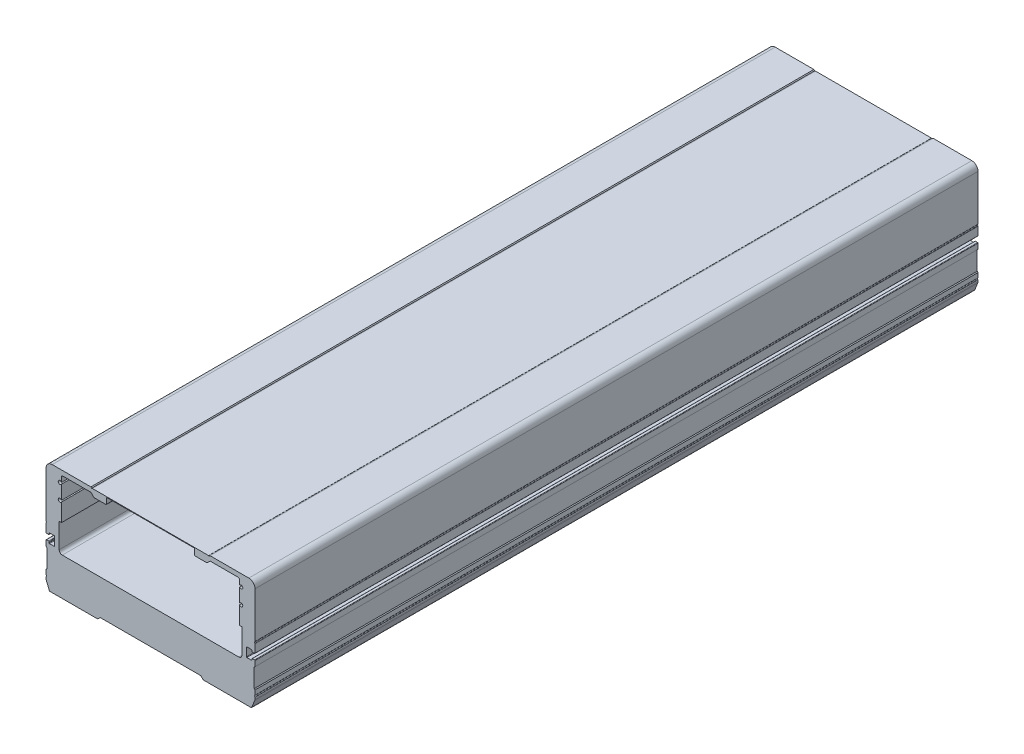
from build123d import *

# Parameters (mm, degrees)
EXTRUDE_1_DEPTH      = 467
HOLE_WIZARD_M6_D     = 5
HOLE_WIZARD_M6_DEPTH = 15
HOLE_WIZARD_M6_TIP   = 1.502151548


with BuildPart() as part:
    # Sketch 1 → Extrude 1 (new body)
    with BuildSketch(Plane.XY):
        with BuildLine():
            Line((-67.5, 66.1), (-67.5, 36.604669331))
            ThreePointArc((-67.5, 36.604669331), (-67.454950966, 36.446555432), (-67.3333333, 36.33592739))
            ThreePointArc((-67.3333333, 36.33592739), (-67.125, 35.999999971), (-67.333333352, 35.664072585))
            ThreePointArc((-67.333333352, 35.664072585), (-67.454950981, 35.553444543), (-67.5, 35.395330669))
            Line((-67.5, 35.395330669), (-67.5, 30.1))
            ThreePointArc((-67.5, 30.1), (-67.412132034, 29.887867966), (-67.2, 29.8))
            Line((-67.2, 29.8), (-65.8, 29.8))
            ThreePointArc((-65.8, 29.8), (-65.587867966, 29.887867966), (-65.5, 30.1))
            Line((-65.5, 30.1), (-65.5, 30.7))
            ThreePointArc((-65.5, 30.7), (-65.412132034, 30.912132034), (-65.2, 31))
            Line((-65.2, 31), (-62.3, 31))
            ThreePointArc((-62.3, 31), (-62.087867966, 30.912132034), (-62, 30.7))
            Line((-62, 30.7), (-62, 25.3))
            ThreePointArc((-62, 25.3), (-62.087867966, 25.087867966), (-62.3, 25))
            Line((-62.3, 25), (-65.2, 25))
            ThreePointArc((-65.2, 25), (-65.412132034, 25.087867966), (-65.5, 25.3))
            Line((-65.5, 25.3), (-65.5, 25.9))
            ThreePointArc((-65.5, 25.9), (-65.587867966, 26.112132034), (-65.8, 26.2))
            Line((-65.8, 26.2), (-67.2, 26.2))
            ThreePointArc((-67.2, 26.2), (-67.412132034, 26.112132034), (-67.5, 25.9))
            Line((-67.5, 25.9), (-67.5, 22.5))
            Line((-67.5, 22.5), (-67, 22))
            Line((-67, 22), (-67, 10))
            Line((-67, 10), (-67.5, 9.5))
            Line((-67.5, 9.5), (-67.5, 6.604669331))
            ThreePointArc((-67.5, 6.604669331), (-67.454950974, 6.446555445), (-67.333333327, 6.335927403))
            ThreePointArc((-67.333333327, 6.335927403), (-67.125, 5.999999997), (-67.333333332, 5.664072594))
            ThreePointArc((-67.333333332, 5.664072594), (-67.454950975, 5.553444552), (-67.5, 5.395330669))
            Line((-67.5, 5.395330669), (-67.5, 4.381968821))
            ThreePointArc((-67.5, 4.381968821), (-67.464493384, 4.00678121), (-67.359234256, 3.644915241))
            Line((-67.359234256, 3.644915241), (-65.506419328, -1.028852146))
            ThreePointArc((-65.506419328, -1.028852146), (-65.35722349, -1.328991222), (-65.16, -1.6))
            Line((-65.16, -1.6), (-34.1, -1.6))
            Line((-34.1, -1.6), (-32.5, 0))
            Line((-32.5, 0), (32.5, 0))
            Line((32.5, 0), (34.1, -1.6))
            Line((34.1, -1.6), (65.16, -1.6))
            ThreePointArc((65.16, -1.6), (65.35722349, -1.328991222), (65.506419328, -1.028852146))
            Line((65.506419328, -1.028852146), (67.359234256, 3.644915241))
            ThreePointArc((67.359234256, 3.644915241), (67.464493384, 4.00678121), (67.5, 4.381968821))
            Line((67.5, 4.381968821), (67.5, 5.395330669))
            ThreePointArc((67.5, 5.395330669), (67.454950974, 5.553444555), (67.333333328, 5.664072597))
            ThreePointArc((67.333333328, 5.664072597), (67.125, 6.000000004), (67.333333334, 6.335927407))
            ThreePointArc((67.333333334, 6.335927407), (67.454950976, 6.446555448), (67.5, 6.604669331))
            Line((67.5, 6.604669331), (67.5, 9.5))
            Line((67.5, 9.5), (67, 10))
            Line((67, 10), (67, 22))
            Line((67, 22), (67.5, 22.5))
            Line((67.5, 22.5), (67.5, 25.9))
            ThreePointArc((67.5, 25.9), (67.412132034, 26.112132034), (67.2, 26.2))
            Line((67.2, 26.2), (65.8, 26.2))
            ThreePointArc((65.8, 26.2), (65.587867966, 26.112132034), (65.5, 25.9))
            Line((65.5, 25.9), (65.5, 25.3))
            ThreePointArc((65.5, 25.3), (65.412132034, 25.087867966), (65.2, 25))
            Line((65.2, 25), (62.3, 25))
            ThreePointArc((62.3, 25), (62.087867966, 25.087867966), (62, 25.3))
            Line((62, 25.3), (62, 30.7))
            ThreePointArc((62, 30.7), (62.087867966, 30.912132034), (62.3, 31))
            Line((62.3, 31), (65.2, 31))
            ThreePointArc((65.2, 31), (65.412132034, 30.912132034), (65.5, 30.7))
            Line((65.5, 30.7), (65.5, 30.1))
            ThreePointArc((65.5, 30.1), (65.587867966, 29.887867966), (65.8, 29.8))
            Line((65.8, 29.8), (67.2, 29.8))
            ThreePointArc((67.2, 29.8), (67.412132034, 29.887867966), (67.5, 30.1))
            Line((67.5, 30.1), (67.5, 35.395330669))
            ThreePointArc((67.5, 35.395330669), (67.454950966, 35.553444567), (67.333333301, 35.66407261))
            ThreePointArc((67.333333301, 35.66407261), (67.125, 36.000000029), (67.333333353, 36.335927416))
            ThreePointArc((67.333333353, 36.335927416), (67.454950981, 36.446555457), (67.5, 36.604669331))
            Line((67.5, 36.604669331), (67.5, 66.1))
            ThreePointArc((67.5, 66.1), (66.328427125, 68.928427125), (63.5, 70.1))
            Line((63.5, 70.1), (38.5, 70.1))
            Line((38.5, 70.1), (38, 69.6))
            Line((38, 69.6), (37.5, 69.6))
            Line((37.5, 69.6), (37.5, 69.7))
            Line((37.5, 69.7), (-37.5, 69.7))
            Line((-37.5, 69.7), (-37.5, 69.6))
            Line((-37.5, 69.6), (-38, 69.6))
            Line((-38, 69.6), (-38.5, 70.1))
            Line((-38.5, 70.1), (-63.5, 70.1))
            ThreePointArc((-63.5, 70.1), (-66.328427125, 68.928427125), (-67.5, 66.1))
        make_face()
        with BuildLine():
            Line((-57, 22.7), (57, 22.7))
            ThreePointArc((57, 22.7), (58.414213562, 23.285786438), (59, 24.7))
            Line((59, 24.7), (59, 40.6))
            Line((59, 40.6), (57.5, 40.6))
            Line((57.5, 40.6), (57.5, 52.141742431))
            ThreePointArc((57.5, 52.141742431), (59.6, 52.6), (57.5, 53.058257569))
            Line((57.5, 53.058257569), (57.5, 62.141742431))
            ThreePointArc((57.5, 62.141742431), (59.6, 62.6), (57.5, 63.058257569))
            Line((57.5, 63.058257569), (57.5, 66.1))
            ThreePointArc((57.5, 66.1), (57.207106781, 66.807106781), (56.5, 67.1))
            Line((56.5, 67.1), (38.5, 67.1))
            Line((38.5, 67.1), (36.5, 65.1))
            Line((36.5, 65.1), (28.8, 65.1))
            ThreePointArc((28.8, 65.1), (28.587867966, 65.187867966), (28.5, 65.4))
            Line((28.5, 65.4), (28.5, 69.3))
            Line((28.5, 69.3), (-28.5, 69.3))
            Line((-28.5, 69.3), (-28.5, 65.4))
            ThreePointArc((-28.5, 65.4), (-28.587867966, 65.187867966), (-28.8, 65.1))
            Line((-28.8, 65.1), (-36.5, 65.1))
            Line((-36.5, 65.1), (-38.5, 67.1))
            Line((-38.5, 67.1), (-56.5, 67.1))
            ThreePointArc((-56.5, 67.1), (-57.207106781, 66.807106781), (-57.5, 66.1))
            Line((-57.5, 66.1), (-57.5, 63.058257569))
            ThreePointArc((-57.5, 63.058257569), (-59.6, 62.6), (-57.5, 62.141742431))
            Line((-57.5, 62.141742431), (-57.5, 53.058257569))
            ThreePointArc((-57.5, 53.058257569), (-59.6, 52.6), (-57.5, 52.141742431))
            Line((-57.5, 52.141742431), (-57.5, 40.6))
            Line((-57.5, 40.6), (-59.3, 40.6))
            ThreePointArc((-59.3, 40.6), (-59.087867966, 40.512132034), (-59, 40.3))
            Line((-59, 40.3), (-59, 24.7))
            ThreePointArc((-59, 24.7), (-58.414213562, 23.285786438), (-57, 22.7))
        make_face(mode=Mode.SUBTRACT)
    extrude(amount=-EXTRUDE_1_DEPTH)

    # Hole Wizard M6
    with Locations(Plane(origin=(0, -1.6, 0), x_dir=(-1, 0, 0), z_dir=(0, -1, 0))):
        with Locations((53, 415.5), (-53, 415.5), (53, 265.5), (-53, 265.5), (-53, 65.5), (53, 65.5), (-53, -134.5), (53, -134.5), (-53, -334.5), (53, -334.5), (-53, -534.5), (53, -534.5), (53, -734.5), (-53, -734.5)):
            Hole(HOLE_WIZARD_M6_D / 2, depth=HOLE_WIZARD_M6_DEPTH)
            with Locations((0, 0, -(HOLE_WIZARD_M6_DEPTH + HOLE_WIZARD_M6_TIP / 2))):  # 118° drill point
                Cone(0, HOLE_WIZARD_M6_D / 2, HOLE_WIZARD_M6_TIP, mode=Mode.SUBTRACT)


solid = part.part
